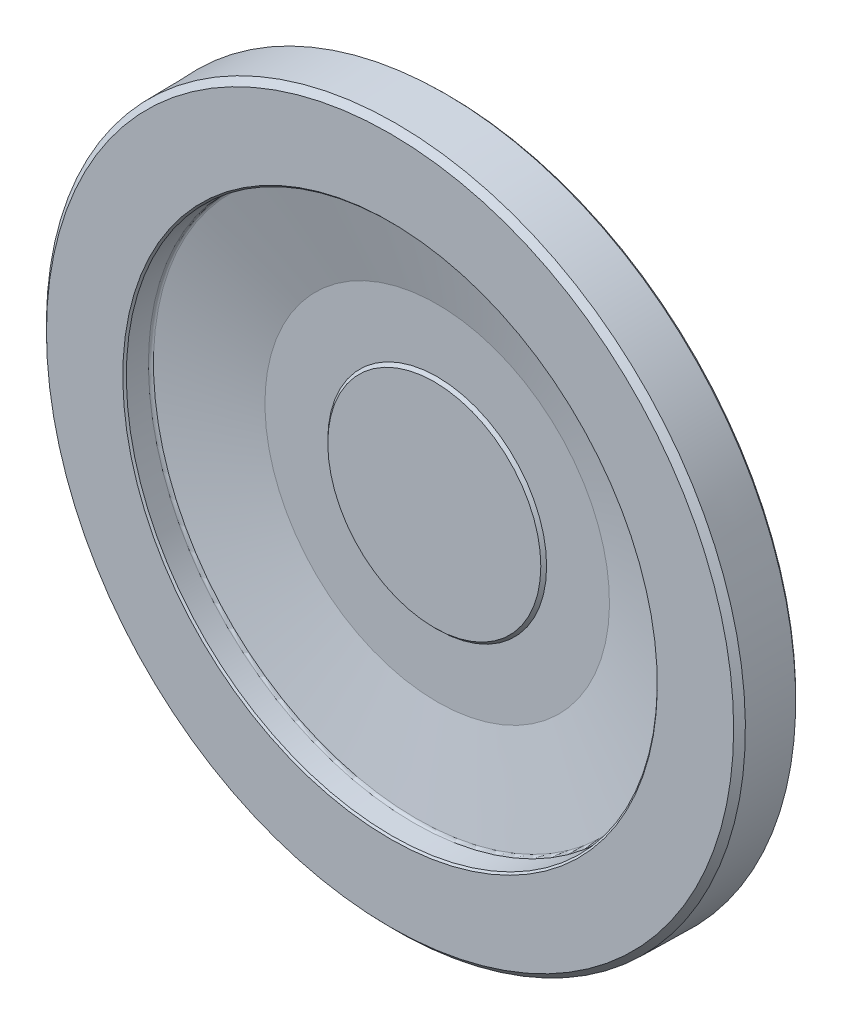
ISO-10303-21;
HEADER;
FILE_DESCRIPTION(('STEP AP214'),'2;1');
FILE_NAME('part.step','',(''),(''),'','','');
FILE_SCHEMA(('AUTOMOTIVE_DESIGN { 1 0 10303 214 1 1 1 1 }'));
ENDSEC;
DATA;
#1=APPLICATION_CONTEXT('core data for automotive mechanical design processes');
#2=APPLICATION_PROTOCOL_DEFINITION('international standard','automotive_design',2000,#1);
#3=PRODUCT_CONTEXT('',#1,'mechanical');
#4=PRODUCT('Part','Part','',(#3));
#5=PRODUCT_RELATED_PRODUCT_CATEGORY('part','',(#4));
#6=PRODUCT_DEFINITION_FORMATION('','',#4);
#7=PRODUCT_DEFINITION_CONTEXT('part definition',#1,'design');
#8=PRODUCT_DEFINITION('design','',#6,#7);
#9=PRODUCT_DEFINITION_SHAPE('','',#8);
#10=(LENGTH_UNIT() NAMED_UNIT(*) SI_UNIT(.MILLI.,.METRE.));
#11=(NAMED_UNIT(*) PLANE_ANGLE_UNIT() SI_UNIT($,.RADIAN.));
#12=(NAMED_UNIT(*) SI_UNIT($,.STERADIAN.) SOLID_ANGLE_UNIT());
#13=UNCERTAINTY_MEASURE_WITH_UNIT(LENGTH_MEASURE(1.E-05),#10,'distance_accuracy_value','');
#14=(GEOMETRIC_REPRESENTATION_CONTEXT(3) GLOBAL_UNCERTAINTY_ASSIGNED_CONTEXT((#13)) GLOBAL_UNIT_ASSIGNED_CONTEXT((#10,
#11,#12)) REPRESENTATION_CONTEXT('',''));
#15=CARTESIAN_POINT('',(0.,0.,0.));
#16=DIRECTION('',(0.,0.,1.));
#17=DIRECTION('',(1.,0.,0.));
#18=AXIS2_PLACEMENT_3D('',#15,#16,#17);
#19=CARTESIAN_POINT('',(0.,0.,56.));
#20=DIRECTION('',(0.,0.,-1.));
#21=DIRECTION('',(0.,1.,0.));
#22=AXIS2_PLACEMENT_3D('',#19,#20,#21);
#23=PLANE('',#22);
#24=CARTESIAN_POINT('',(0.,0.,56.));
#25=DIRECTION('',(0.,0.,-1.));
#26=DIRECTION('',(1.,0.,0.));
#27=AXIS2_PLACEMENT_3D('',#24,#25,#26);
#28=CIRCLE('',#27,45.75);
#29=CARTESIAN_POINT('',(45.75,0.,56.));
#30=VERTEX_POINT('',#29);
#31=EDGE_CURVE('E15',#30,#30,#28,.T.);
#32=ORIENTED_EDGE('',*,*,#31,.F.);
#33=EDGE_LOOP('',(#32));
#34=FACE_BOUND('',#33,.T.);
#35=ADVANCED_FACE('F12',(#34),#23,.F.);
#36=CARTESIAN_POINT('',(0.,0.,54.75));
#37=DIRECTION('',(0.,0.,-1.));
#38=DIRECTION('',(1.,0.,0.));
#39=AXIS2_PLACEMENT_3D('',#36,#37,#38);
#40=CONICAL_SURFACE('',#39,47.,0.785398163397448);
#41=ORIENTED_EDGE('',*,*,#31,.T.);
#42=EDGE_LOOP('',(#41));
#43=FACE_BOUND('',#42,.T.);
#44=CARTESIAN_POINT('',(0.,0.,54.75));
#45=DIRECTION('',(0.,0.,-1.));
#46=DIRECTION('',(1.,0.,0.));
#47=AXIS2_PLACEMENT_3D('',#44,#45,#46);
#48=CIRCLE('',#47,47.);
#49=CARTESIAN_POINT('',(47.,0.,54.75));
#50=VERTEX_POINT('',#49);
#51=EDGE_CURVE('E148',#50,#50,#48,.F.);
#52=ORIENTED_EDGE('',*,*,#51,.T.);
#53=EDGE_LOOP('',(#52));
#54=FACE_BOUND('',#53,.T.);
#55=ADVANCED_FACE('F103',(#43,#54),#40,.T.);
#56=CARTESIAN_POINT('',(47.,0.,54.75));
#57=DIRECTION('',(0.,0.,-1.));
#58=DIRECTION('',(0.,1.,0.));
#59=AXIS2_PLACEMENT_3D('',#56,#57,#58);
#60=PLANE('',#59);
#61=ORIENTED_EDGE('',*,*,#51,.F.);
#62=EDGE_LOOP('',(#61));
#63=FACE_BOUND('',#62,.T.);
#64=CARTESIAN_POINT('',(0.,0.,54.75));
#65=DIRECTION('',(0.,0.,1.));
#66=DIRECTION('',(0.,-1.,0.));
#67=AXIS2_PLACEMENT_3D('',#64,#65,#66);
#68=CIRCLE('',#67,74.);
#69=CARTESIAN_POINT('',(0.,-74.,54.75));
#70=VERTEX_POINT('',#69);
#71=EDGE_CURVE('E146',#70,#70,#68,.T.);
#72=ORIENTED_EDGE('',*,*,#71,.T.);
#73=EDGE_LOOP('',(#72));
#74=FACE_BOUND('',#73,.T.);
#75=ADVANCED_FACE('F100',(#63,#74),#60,.F.);
#76=CARTESIAN_POINT('',(0.,0.,63.7295206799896));
#77=DIRECTION('',(0.,0.,1.));
#78=DIRECTION('',(0.,-1.,0.));
#79=AXIS2_PLACEMENT_3D('',#76,#77,#78);
#80=CONICAL_SURFACE('',#79,112.89457718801,1.34390352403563);
#81=ORIENTED_EDGE('',*,*,#71,.F.);
#82=EDGE_LOOP('',(#81));
#83=FACE_BOUND('',#82,.T.);
#84=CARTESIAN_POINT('',(0.,0.,63.7295206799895));
#85=DIRECTION('',(0.,0.,-1.));
#86=DIRECTION('',(0.,1.,0.));
#87=AXIS2_PLACEMENT_3D('',#84,#85,#86);
#88=CIRCLE('',#87,112.89457718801);
#89=CARTESIAN_POINT('',(0.,112.89457718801,63.7295206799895));
#90=VERTEX_POINT('',#89);
#91=EDGE_CURVE('E83',#90,#90,#88,.F.);
#92=ORIENTED_EDGE('',*,*,#91,.T.);
#93=EDGE_LOOP('',(#92));
#94=FACE_BOUND('',#93,.T.);
#95=ADVANCED_FACE('F95',(#83,#94),#80,.F.);
#96=CARTESIAN_POINT('',(0.,0.,64.947483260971));
#97=DIRECTION('',(0.,0.,-1.));
#98=DIRECTION('',(0.,1.,0.));
#99=AXIS2_PLACEMENT_3D('',#96,#97,#98);
#100=TOROIDAL_SURFACE('',#99,112.61338837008,1.25000000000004);
#101=ORIENTED_EDGE('',*,*,#91,.F.);
#102=EDGE_LOOP('',(#101));
#103=FACE_BOUND('',#102,.T.);
#104=CARTESIAN_POINT('',(0.,0.,64.9256677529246));
#105=DIRECTION('',(0.,0.,1.));
#106=DIRECTION('',(0.,-1.,0.));
#107=AXIS2_PLACEMENT_3D('',#104,#105,#106);
#108=CIRCLE('',#107,113.863197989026);
#109=CARTESIAN_POINT('',(0.,-113.863197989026,64.925667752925));
#110=VERTEX_POINT('',#109);
#111=EDGE_CURVE('E78',#110,#110,#108,.T.);
#112=ORIENTED_EDGE('',*,*,#111,.T.);
#113=EDGE_LOOP('',(#112));
#114=FACE_BOUND('',#113,.T.);
#115=ADVANCED_FACE('F90',(#103,#114),#100,.F.);
#116=CARTESIAN_POINT('',(0.,0.,74.250114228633));
#117=DIRECTION('',(0.,0.,1.));
#118=DIRECTION('',(0.,-1.,0.));
#119=AXIS2_PLACEMENT_3D('',#116,#117,#118);
#120=CONICAL_SURFACE('',#119,114.025956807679,0.0174532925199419);
#121=ORIENTED_EDGE('',*,*,#111,.F.);
#122=EDGE_LOOP('',(#121));
#123=FACE_BOUND('',#122,.T.);
#124=CARTESIAN_POINT('',(0.,0.,74.2501142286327));
#125=DIRECTION('',(0.,0.,1.));
#126=DIRECTION('',(0.,-1.,0.));
#127=AXIS2_PLACEMENT_3D('',#124,#125,#126);
#128=CIRCLE('',#127,114.025956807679);
#129=CARTESIAN_POINT('',(0.,-114.025956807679,74.2501142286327));
#130=VERTEX_POINT('',#129);
#131=EDGE_CURVE('E74',#130,#130,#128,.T.);
#132=ORIENTED_EDGE('',*,*,#131,.T.);
#133=EDGE_LOOP('',(#132));
#134=FACE_BOUND('',#133,.T.);
#135=ADVANCED_FACE('F94',(#123,#134),#120,.F.);
#136=CARTESIAN_POINT('',(0.,0.,75.));
#137=DIRECTION('',(0.,0.,1.));
#138=DIRECTION('',(0.,-1.,0.));
#139=AXIS2_PLACEMENT_3D('',#136,#137,#138);
#140=CONICAL_SURFACE('',#139,114.789046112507,0.794124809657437);
#141=ORIENTED_EDGE('',*,*,#131,.F.);
#142=EDGE_LOOP('',(#141));
#143=FACE_BOUND('',#142,.T.);
#144=CARTESIAN_POINT('',(0.,0.,75.));
#145=DIRECTION('',(0.,0.,1.));
#146=DIRECTION('',(0.,-1.,0.));
#147=AXIS2_PLACEMENT_3D('',#144,#145,#146);
#148=CIRCLE('',#147,114.789046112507);
#149=CARTESIAN_POINT('',(0.,-114.789046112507,75.));
#150=VERTEX_POINT('',#149);
#151=EDGE_CURVE('E77',#150,#150,#148,.T.);
#152=ORIENTED_EDGE('',*,*,#151,.T.);
#153=EDGE_LOOP('',(#152));
#154=FACE_BOUND('',#153,.T.);
#155=ADVANCED_FACE('F162',(#143,#154),#140,.F.);
#156=CARTESIAN_POINT('',(114.789046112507,0.,75.));
#157=DIRECTION('',(0.,0.,-1.));
#158=DIRECTION('',(0.,1.,0.));
#159=AXIS2_PLACEMENT_3D('',#156,#157,#158);
#160=PLANE('',#159);
#161=ORIENTED_EDGE('',*,*,#151,.F.);
#162=EDGE_LOOP('',(#161));
#163=FACE_BOUND('',#162,.T.);
#164=CARTESIAN_POINT('',(0.,0.,75.));
#165=DIRECTION('',(0.,0.,-1.));
#166=DIRECTION('',(0.,1.,0.));
#167=AXIS2_PLACEMENT_3D('',#164,#165,#166);
#168=CIRCLE('',#167,147.585442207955);
#169=CARTESIAN_POINT('',(0.,147.585442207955,75.));
#170=VERTEX_POINT('',#169);
#171=EDGE_CURVE('E141',#170,#170,#168,.T.);
#172=ORIENTED_EDGE('',*,*,#171,.F.);
#173=EDGE_LOOP('',(#172));
#174=FACE_BOUND('',#173,.T.);
#175=ADVANCED_FACE('F167',(#163,#174),#160,.F.);
#176=CARTESIAN_POINT('',(28.1,0.,0.));
#177=DIRECTION('',(0.,0.,1.));
#178=DIRECTION('',(0.,-1.,0.));
#179=AXIS2_PLACEMENT_3D('',#176,#177,#178);
#180=PLANE('',#179);
#181=CARTESIAN_POINT('',(0.,0.,0.));
#182=DIRECTION('',(0.,0.,1.));
#183=DIRECTION('',(-1.,0.,0.));
#184=AXIS2_PLACEMENT_3D('',#181,#182,#183);
#185=CIRCLE('',#184,28.1);
#186=CARTESIAN_POINT('',(-28.1,0.,0.));
#187=VERTEX_POINT('',#186);
#188=EDGE_CURVE('E71',#187,#187,#185,.T.);
#189=ORIENTED_EDGE('',*,*,#188,.F.);
#190=EDGE_LOOP('',(#189));
#191=FACE_BOUND('',#190,.T.);
#192=ADVANCED_FACE('F172',(#191),#180,.F.);
#193=CARTESIAN_POINT('',(0.,0.,72.5003807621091));
#194=DIRECTION('',(0.,0.,-1.));
#195=DIRECTION('',(0.,1.,0.));
#196=AXIS2_PLACEMENT_3D('',#193,#194,#195);
#197=CONICAL_SURFACE('',#196,150.129073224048,0.794124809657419);
#198=ORIENTED_EDGE('',*,*,#171,.T.);
#199=EDGE_LOOP('',(#198));
#200=FACE_BOUND('',#199,.T.);
#201=CARTESIAN_POINT('',(0.,0.,72.5003807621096));
#202=DIRECTION('',(0.,0.,-1.));
#203=DIRECTION('',(0.,1.,0.));
#204=AXIS2_PLACEMENT_3D('',#201,#202,#203);
#205=CIRCLE('',#204,150.129073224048);
#206=CARTESIAN_POINT('',(0.,150.129073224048,72.5003807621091));
#207=VERTEX_POINT('',#206);
#208=EDGE_CURVE('E66',#207,#207,#205,.T.);
#209=ORIENTED_EDGE('',*,*,#208,.F.);
#210=EDGE_LOOP('',(#209));
#211=FACE_BOUND('',#210,.T.);
#212=ADVANCED_FACE('F176',(#200,#211),#197,.T.);
#213=CARTESIAN_POINT('',(0.,0.,0.9));
#214=DIRECTION('',(0.,0.,1.));
#215=DIRECTION('',(-1.,0.,0.));
#216=AXIS2_PLACEMENT_3D('',#213,#214,#215);
#217=CONICAL_SURFACE('',#216,29.,0.785398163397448);
#218=CARTESIAN_POINT('',(0.,0.,0.9));
#219=DIRECTION('',(0.,0.,1.));
#220=DIRECTION('',(0.,-1.,0.));
#221=AXIS2_PLACEMENT_3D('',#218,#219,#220);
#222=CIRCLE('',#221,29.);
#223=CARTESIAN_POINT('',(0.,-29.,0.9));
#224=VERTEX_POINT('',#223);
#225=EDGE_CURVE('E61',#224,#224,#222,.T.);
#226=ORIENTED_EDGE('',*,*,#225,.F.);
#227=EDGE_LOOP('',(#226));
#228=FACE_BOUND('',#227,.T.);
#229=ORIENTED_EDGE('',*,*,#188,.T.);
#230=EDGE_LOOP('',(#229));
#231=FACE_BOUND('',#230,.T.);
#232=ADVANCED_FACE('F179',(#228,#231),#217,.T.);
#233=CARTESIAN_POINT('',(0.,0.,51.2498096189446));
#234=DIRECTION('',(0.,0.,-1.));
#235=DIRECTION('',(1.,0.,0.));
#236=AXIS2_PLACEMENT_3D('',#233,#234,#235);
#237=CONICAL_SURFACE('',#236,150.500003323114,0.0174532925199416);
#238=ORIENTED_EDGE('',*,*,#208,.T.);
#239=EDGE_LOOP('',(#238));
#240=FACE_BOUND('',#239,.T.);
#241=CARTESIAN_POINT('',(0.,0.,51.2498096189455));
#242=DIRECTION('',(0.,0.,1.));
#243=DIRECTION('',(0.,-1.,0.));
#244=AXIS2_PLACEMENT_3D('',#241,#242,#243);
#245=CIRCLE('',#244,150.500003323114);
#246=CARTESIAN_POINT('',(0.,-150.500003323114,51.2498096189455));
#247=VERTEX_POINT('',#246);
#248=EDGE_CURVE('E57',#247,#247,#245,.F.);
#249=ORIENTED_EDGE('',*,*,#248,.F.);
#250=EDGE_LOOP('',(#249));
#251=FACE_BOUND('',#250,.T.);
#252=ADVANCED_FACE('F183',(#240,#251),#237,.T.);
#253=CARTESIAN_POINT('',(0.,0.,0.));
#254=DIRECTION('',(0.,0.,1.));
#255=DIRECTION('',(0.,-1.,0.));
#256=AXIS2_PLACEMENT_3D('',#253,#254,#255);
#257=CYLINDRICAL_SURFACE('',#256,29.);
#258=CARTESIAN_POINT('',(0.,0.,18.));
#259=DIRECTION('',(0.,0.,1.));
#260=DIRECTION('',(0.,-1.,0.));
#261=AXIS2_PLACEMENT_3D('',#258,#259,#260);
#262=CIRCLE('',#261,29.);
#263=CARTESIAN_POINT('',(0.,-29.,18.));
#264=VERTEX_POINT('',#263);
#265=EDGE_CURVE('E60',#264,#264,#262,.F.);
#266=ORIENTED_EDGE('',*,*,#265,.T.);
#267=EDGE_LOOP('',(#266));
#268=FACE_BOUND('',#267,.T.);
#269=ORIENTED_EDGE('',*,*,#225,.T.);
#270=EDGE_LOOP('',(#269));
#271=FACE_BOUND('',#270,.T.);
#272=ADVANCED_FACE('F186',(#268,#271),#257,.T.);
#273=CARTESIAN_POINT('',(0.,0.,51.2498096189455));
#274=DIRECTION('',(0.,0.,1.));
#275=DIRECTION('',(-1.,0.,0.));
#276=AXIS2_PLACEMENT_3D('',#273,#274,#275);
#277=CONICAL_SURFACE('',#276,150.500003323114,0.776671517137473);
#278=ORIENTED_EDGE('',*,*,#248,.T.);
#279=EDGE_LOOP('',(#278));
#280=FACE_BOUND('',#279,.T.);
#281=CARTESIAN_POINT('',(0.,0.,50.));
#282=DIRECTION('',(0.,0.,1.));
#283=DIRECTION('',(-1.,0.,0.));
#284=AXIS2_PLACEMENT_3D('',#281,#282,#283);
#285=CIRCLE('',#284,149.27181883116);
#286=CARTESIAN_POINT('',(-149.27181883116,0.,50.));
#287=VERTEX_POINT('',#286);
#288=EDGE_CURVE('E130',#287,#287,#285,.T.);
#289=ORIENTED_EDGE('',*,*,#288,.T.);
#290=EDGE_LOOP('',(#289));
#291=FACE_BOUND('',#290,.T.);
#292=ADVANCED_FACE('F190',(#280,#291),#277,.T.);
#293=CARTESIAN_POINT('',(41.,0.,18.));
#294=DIRECTION('',(0.,0.,1.));
#295=DIRECTION('',(0.,-1.,0.));
#296=AXIS2_PLACEMENT_3D('',#293,#294,#295);
#297=PLANE('',#296);
#298=CARTESIAN_POINT('',(0.,0.,18.));
#299=DIRECTION('',(0.,0.,1.));
#300=DIRECTION('',(0.,-1.,0.));
#301=AXIS2_PLACEMENT_3D('',#298,#299,#300);
#302=CIRCLE('',#301,41.);
#303=CARTESIAN_POINT('',(0.,-41.,18.));
#304=VERTEX_POINT('',#303);
#305=EDGE_CURVE('E128',#304,#304,#302,.T.);
#306=ORIENTED_EDGE('',*,*,#305,.F.);
#307=EDGE_LOOP('',(#306));
#308=FACE_BOUND('',#307,.T.);
#309=ORIENTED_EDGE('',*,*,#265,.F.);
#310=EDGE_LOOP('',(#309));
#311=FACE_BOUND('',#310,.T.);
#312=ADVANCED_FACE('F193',(#308,#311),#297,.F.);
#313=CARTESIAN_POINT('',(149.27181883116,0.,50.));
#314=DIRECTION('',(0.,0.,1.));
#315=DIRECTION('',(0.,-1.,0.));
#316=AXIS2_PLACEMENT_3D('',#313,#314,#315);
#317=PLANE('',#316);
#318=ORIENTED_EDGE('',*,*,#288,.F.);
#319=EDGE_LOOP('',(#318));
#320=FACE_BOUND('',#319,.T.);
#321=CARTESIAN_POINT('',(0.,0.,50.));
#322=DIRECTION('',(0.,0.,1.));
#323=DIRECTION('',(0.,-1.,0.));
#324=AXIS2_PLACEMENT_3D('',#321,#322,#323);
#325=CIRCLE('',#324,113.846153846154);
#326=CARTESIAN_POINT('',(0.,-113.846153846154,50.));
#327=VERTEX_POINT('',#326);
#328=EDGE_CURVE('E54',#327,#327,#325,.T.);
#329=ORIENTED_EDGE('',*,*,#328,.T.);
#330=EDGE_LOOP('',(#329));
#331=FACE_BOUND('',#330,.T.);
#332=ADVANCED_FACE('F125',(#320,#331),#317,.F.);
#333=CARTESIAN_POINT('',(0.,0.,0.));
#334=DIRECTION('',(0.,0.,1.));
#335=DIRECTION('',(0.,-1.,0.));
#336=AXIS2_PLACEMENT_3D('',#333,#334,#335);
#337=CYLINDRICAL_SURFACE('',#336,41.);
#338=CARTESIAN_POINT('',(0.,0.,29.1356494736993));
#339=DIRECTION('',(0.,0.,-1.));
#340=DIRECTION('',(0.,1.,0.));
#341=AXIS2_PLACEMENT_3D('',#338,#339,#340);
#342=CIRCLE('',#341,41.);
#343=CARTESIAN_POINT('',(0.,41.,29.1356494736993));
#344=VERTEX_POINT('',#343);
#345=EDGE_CURVE('E51',#344,#344,#342,.T.);
#346=ORIENTED_EDGE('',*,*,#345,.T.);
#347=EDGE_LOOP('',(#346));
#348=FACE_BOUND('',#347,.T.);
#349=ORIENTED_EDGE('',*,*,#305,.T.);
#350=EDGE_LOOP('',(#349));
#351=FACE_BOUND('',#350,.T.);
#352=ADVANCED_FACE('F122',(#348,#351),#337,.T.);
#353=CARTESIAN_POINT('',(0.,0.,0.));
#354=DIRECTION('',(0.,0.,1.));
#355=DIRECTION('',(0.,-1.,0.));
#356=AXIS2_PLACEMENT_3D('',#353,#354,#355);
#357=CYLINDRICAL_SURFACE('',#356,113.846153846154);
#358=ORIENTED_EDGE('',*,*,#328,.F.);
#359=EDGE_LOOP('',(#358));
#360=FACE_BOUND('',#359,.T.);
#361=CARTESIAN_POINT('',(0.,0.,55.6148149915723));
#362=DIRECTION('',(0.,0.,-1.));
#363=DIRECTION('',(0.,1.,0.));
#364=AXIS2_PLACEMENT_3D('',#361,#362,#363);
#365=CIRCLE('',#364,113.846153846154);
#366=CARTESIAN_POINT('',(0.,113.846153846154,55.6148149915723));
#367=VERTEX_POINT('',#366);
#368=EDGE_CURVE('E24',#367,#367,#365,.F.);
#369=ORIENTED_EDGE('',*,*,#368,.T.);
#370=EDGE_LOOP('',(#369));
#371=FACE_BOUND('',#370,.T.);
#372=ADVANCED_FACE('F45',(#360,#371),#357,.F.);
#373=CARTESIAN_POINT('',(0.,0.,29.1356494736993));
#374=DIRECTION('',(0.,0.,-1.));
#375=DIRECTION('',(0.,1.,0.));
#376=AXIS2_PLACEMENT_3D('',#373,#374,#375);
#377=TOROIDAL_SURFACE('',#376,43.5,2.5);
#378=CARTESIAN_POINT('',(0.,0.,31.4848810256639));
#379=DIRECTION('',(0.,0.,1.));
#380=DIRECTION('',(0.,-1.,0.));
#381=AXIS2_PLACEMENT_3D('',#378,#379,#380);
#382=CIRCLE('',#381,42.6449496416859);
#383=CARTESIAN_POINT('',(0.,-42.6449496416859,31.4848810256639));
#384=VERTEX_POINT('',#383);
#385=EDGE_CURVE('E19',#384,#384,#382,.T.);
#386=ORIENTED_EDGE('',*,*,#385,.F.);
#387=EDGE_LOOP('',(#386));
#388=FACE_BOUND('',#387,.T.);
#389=ORIENTED_EDGE('',*,*,#345,.F.);
#390=EDGE_LOOP('',(#389));
#391=FACE_BOUND('',#390,.T.);
#392=ADVANCED_FACE('F40',(#388,#391),#377,.F.);
#393=CARTESIAN_POINT('',(0.,0.,55.6148149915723));
#394=DIRECTION('',(0.,0.,-1.));
#395=DIRECTION('',(0.,1.,0.));
#396=AXIS2_PLACEMENT_3D('',#393,#394,#395);
#397=TOROIDAL_SURFACE('',#396,112.596153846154,1.25000000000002);
#398=ORIENTED_EDGE('',*,*,#368,.F.);
#399=EDGE_LOOP('',(#398));
#400=FACE_BOUND('',#399,.T.);
#401=CARTESIAN_POINT('',(0.,0.,56.7894307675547));
#402=DIRECTION('',(0.,0.,1.));
#403=DIRECTION('',(0.,-1.,0.));
#404=AXIS2_PLACEMENT_3D('',#401,#402,#403);
#405=CIRCLE('',#404,112.168628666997);
#406=CARTESIAN_POINT('',(0.,-112.168628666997,56.7894307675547));
#407=VERTEX_POINT('',#406);
#408=EDGE_CURVE('E8',#407,#407,#405,.F.);
#409=ORIENTED_EDGE('',*,*,#408,.F.);
#410=EDGE_LOOP('',(#409));
#411=FACE_BOUND('',#410,.T.);
#412=ADVANCED_FACE('F35',(#400,#411),#397,.F.);
#413=CARTESIAN_POINT('',(0.,0.,56.7894307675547));
#414=DIRECTION('',(0.,0.,1.));
#415=DIRECTION('',(-1.,0.,0.));
#416=AXIS2_PLACEMENT_3D('',#413,#414,#415);
#417=CONICAL_SURFACE('',#416,112.168628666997,1.22173047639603);
#418=ORIENTED_EDGE('',*,*,#408,.T.);
#419=EDGE_LOOP('',(#418));
#420=FACE_BOUND('',#419,.T.);
#421=ORIENTED_EDGE('',*,*,#385,.T.);
#422=EDGE_LOOP('',(#421));
#423=FACE_BOUND('',#422,.T.);
#424=ADVANCED_FACE('F39',(#420,#423),#417,.T.);
#425=CLOSED_SHELL('',(#35,#55,#75,#95,#115,#135,#155,#175,#192,#212,#232,#252,#272,#292,#312,
#332,#352,#372,#392,#412,#424));
#426=MANIFOLD_SOLID_BREP('B1',#425);
#427=ADVANCED_BREP_SHAPE_REPRESENTATION('',(#18,#426),#14);
#428=SHAPE_DEFINITION_REPRESENTATION(#9,#427);
ENDSEC;
END-ISO-10303-21;
